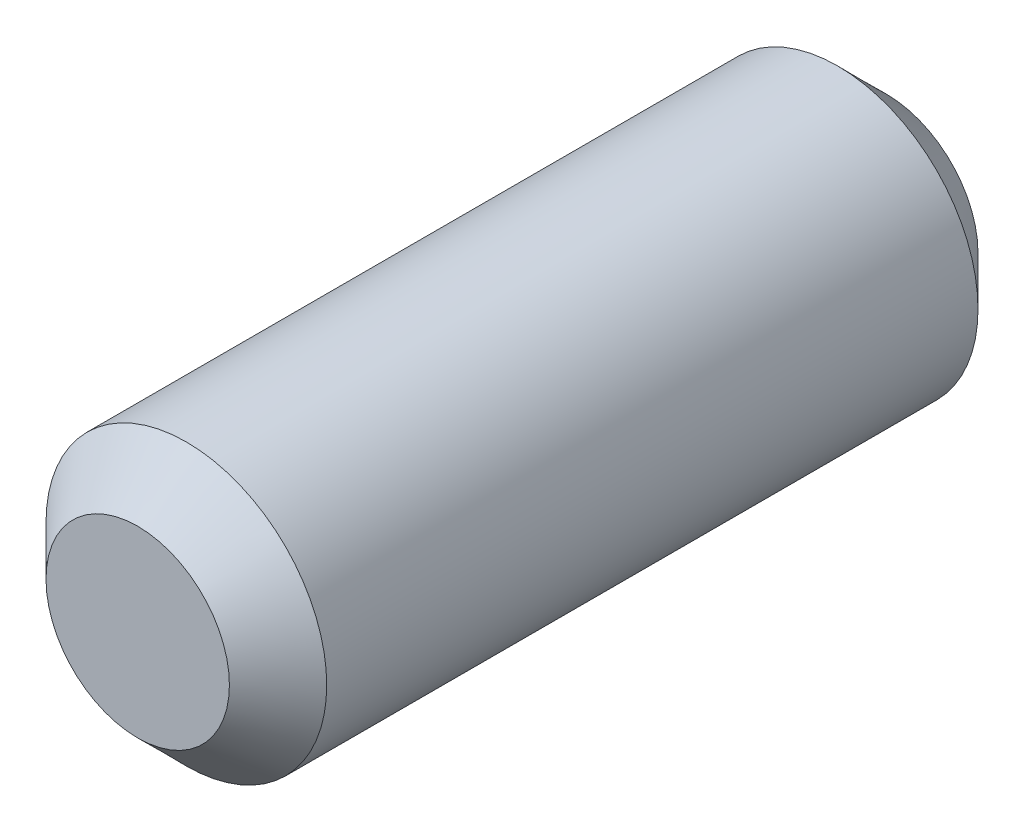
from build123d import *

# Parameters (mm, degrees)
SKETCH1_R      = 2.38125
EXTRUDE1_DEPTH = 6.35
CHAMFER1_SIZE  = 0.8255


with BuildPart() as part:
    # Sketch1 → Extrude1 (new, symmetric)
    with BuildSketch(Plane.XY):
        Circle(SKETCH1_R)
    extrude(amount=EXTRUDE1_DEPTH, both=True)

    # Chamfer1
    chamfer1_edges = [part.edges().sort_by_distance(p)[0] for p in [
        (-2.38125, 0, -6.35),
        (-2.38125, 0, 6.35),
    ]]
    chamfer(chamfer1_edges, length=CHAMFER1_SIZE)


solid = part.part
